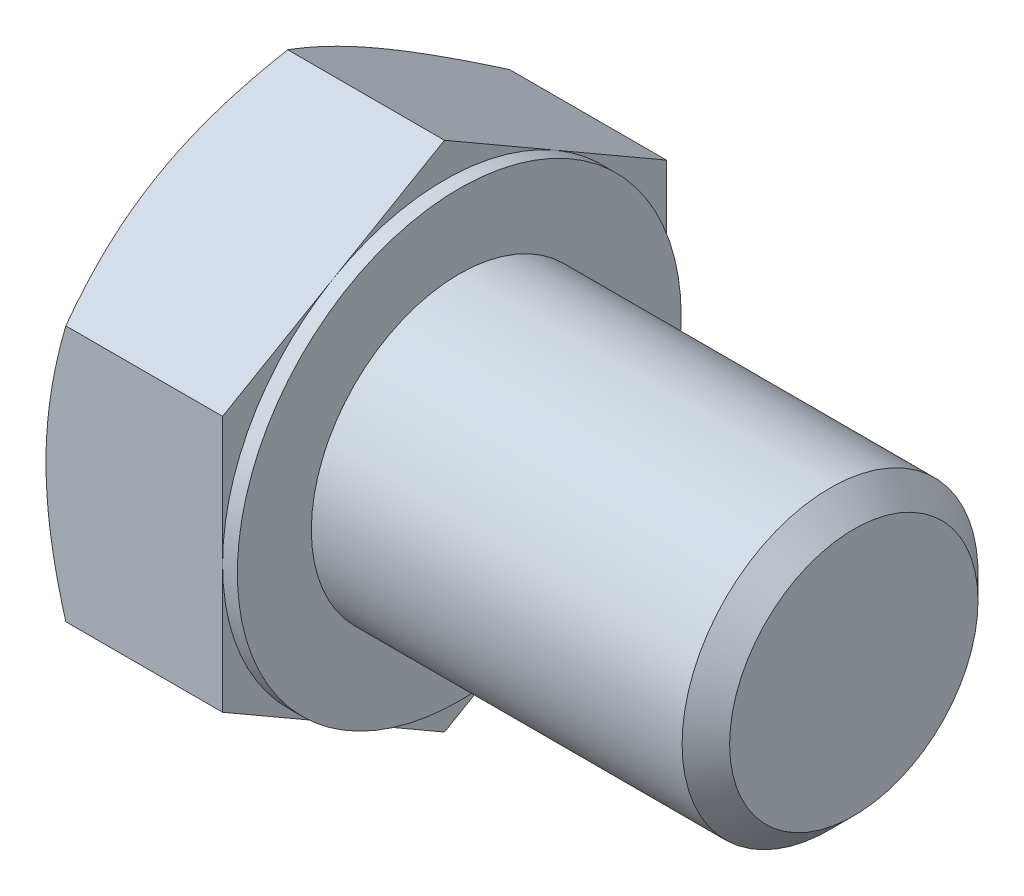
ISO-10303-21;
HEADER;
FILE_DESCRIPTION(('STEP AP214'),'2;1');
FILE_NAME('part.step','',(''),(''),'','','');
FILE_SCHEMA(('AUTOMOTIVE_DESIGN { 1 0 10303 214 1 1 1 1 }'));
ENDSEC;
DATA;
#1=APPLICATION_CONTEXT('core data for automotive mechanical design processes');
#2=APPLICATION_PROTOCOL_DEFINITION('international standard','automotive_design',2000,#1);
#3=PRODUCT_CONTEXT('',#1,'mechanical');
#4=PRODUCT('Part','Part','',(#3));
#5=PRODUCT_RELATED_PRODUCT_CATEGORY('part','',(#4));
#6=PRODUCT_DEFINITION_FORMATION('','',#4);
#7=PRODUCT_DEFINITION_CONTEXT('part definition',#1,'design');
#8=PRODUCT_DEFINITION('design','',#6,#7);
#9=PRODUCT_DEFINITION_SHAPE('','',#8);
#10=(LENGTH_UNIT() NAMED_UNIT(*) SI_UNIT(.MILLI.,.METRE.));
#11=(NAMED_UNIT(*) PLANE_ANGLE_UNIT() SI_UNIT($,.RADIAN.));
#12=(NAMED_UNIT(*) SI_UNIT($,.STERADIAN.) SOLID_ANGLE_UNIT());
#13=UNCERTAINTY_MEASURE_WITH_UNIT(LENGTH_MEASURE(1.E-05),#10,'distance_accuracy_value','');
#14=(GEOMETRIC_REPRESENTATION_CONTEXT(3) GLOBAL_UNCERTAINTY_ASSIGNED_CONTEXT((#13)) GLOBAL_UNIT_ASSIGNED_CONTEXT((#10,
#11,#12)) REPRESENTATION_CONTEXT('',''));
#15=CARTESIAN_POINT('',(0.,0.,0.));
#16=DIRECTION('',(0.,0.,1.));
#17=DIRECTION('',(1.,0.,0.));
#18=AXIS2_PLACEMENT_3D('',#15,#16,#17);
#19=CARTESIAN_POINT('',(7.76,5.19615242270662,-9.));
#20=DIRECTION('',(0.,-0.866025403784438,0.500000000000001));
#21=DIRECTION('',(0.,-0.500000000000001,-0.866025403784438));
#22=AXIS2_PLACEMENT_3D('',#19,#20,#21);
#23=PLANE('',#22);
#24=DIRECTION('',(0.,0.500000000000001,0.866025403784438));
#25=VECTOR('',#24,1.);
#26=CARTESIAN_POINT('',(7.16,5.19615242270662,-9.));
#27=LINE('',#26,#25);
#28=CARTESIAN_POINT('',(7.16,5.19615242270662,-9.));
#29=VERTEX_POINT('',#28);
#30=CARTESIAN_POINT('',(7.16,7.79422863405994,-4.50000000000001));
#31=VERTEX_POINT('',#30);
#32=EDGE_CURVE('E164',#29,#31,#27,.T.);
#33=ORIENTED_EDGE('',*,*,#32,.F.);
#34=DIRECTION('',(-1.,0.,0.));
#35=VECTOR('',#34,1.);
#36=CARTESIAN_POINT('',(7.76,5.19615242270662,-9.));
#37=LINE('',#36,#35);
#38=CARTESIAN_POINT('',(0.803847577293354,5.19615242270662,-9.));
#39=VERTEX_POINT('',#38);
#40=EDGE_CURVE('E297',#29,#39,#37,.T.);
#41=ORIENTED_EDGE('',*,*,#40,.T.);
#42=CARTESIAN_POINT('',(0.803914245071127,10.3924203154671,0.0002));
#43=CARTESIAN_POINT('',(0.737982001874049,10.2782163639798,-0.197607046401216));
#44=CARTESIAN_POINT('',(0.675041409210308,10.1635669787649,-0.396185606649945));
#45=CARTESIAN_POINT('',(0.555968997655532,9.93333715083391,-0.794955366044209));
#46=CARTESIAN_POINT('',(0.499840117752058,9.81775632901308,-0.99514722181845));
#47=CARTESIAN_POINT('',(0.395151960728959,9.58544915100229,-1.3975150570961));
#48=CARTESIAN_POINT('',(0.346610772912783,9.46872074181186,-1.59969459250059));
#49=CARTESIAN_POINT('',(0.258148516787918,9.23447001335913,-2.00542875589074));
#50=CARTESIAN_POINT('',(0.218225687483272,9.11694786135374,-2.20898309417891));
#51=CARTESIAN_POINT('',(0.148684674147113,8.88408932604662,-2.61230590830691));
#52=CARTESIAN_POINT('',(0.118837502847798,8.76877014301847,-2.812044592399));
#53=CARTESIAN_POINT('',(0.0687933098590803,8.53761579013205,-3.21241567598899));
#54=CARTESIAN_POINT('',(0.0485954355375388,8.42178066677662,-3.4130479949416));
#55=CARTESIAN_POINT('',(0.0183543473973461,8.18990950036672,-3.81466063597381));
#56=CARTESIAN_POINT('',(0.00829960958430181,8.07387383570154,-4.01564030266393));
#57=CARTESIAN_POINT('',(-0.00143766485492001,7.84169571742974,-4.41778459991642));
#58=CARTESIAN_POINT('',(-0.00112052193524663,7.72555326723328,-4.61894922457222));
#59=CARTESIAN_POINT('',(0.00916395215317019,7.50842142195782,-4.9950326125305));
#60=CARTESIAN_POINT('',(0.0178767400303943,7.40741671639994,-5.16997789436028));
#61=CARTESIAN_POINT('',(0.0429773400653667,7.20564389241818,-5.51945867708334));
#62=CARTESIAN_POINT('',(0.0593656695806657,7.10487579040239,-5.69399414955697));
#63=CARTESIAN_POINT('',(0.119656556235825,6.8029615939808,-6.2169248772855));
#64=CARTESIAN_POINT('',(0.174677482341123,6.60234990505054,-6.56439451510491));
#65=CARTESIAN_POINT('',(0.312230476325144,6.1989985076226,-7.263019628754));
#66=CARTESIAN_POINT('',(0.395345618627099,5.99631027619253,-7.61408594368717));
#67=CARTESIAN_POINT('',(0.583982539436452,5.59395639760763,-8.3109833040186));
#68=CARTESIAN_POINT('',(0.689460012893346,5.39428559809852,-8.65682327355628));
#69=CARTESIAN_POINT('',(0.80391424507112,5.19603695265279,-9.0002));
#70=B_SPLINE_CURVE_WITH_KNOTS('',3,(#42,#43,#44,#45,#46,#47,#48,#49,#50,#51,#52,#53,#54,#55,#56,
#57,#58,#59,#60,#61,#62,#63,#64,#65,#66,#67,#68,#69),.UNSPECIFIED.,.F.,.F.,(4,2,2,2,2,2,2,2,2,2,
2,2,2,4),(0.,0.713219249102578,1.42674513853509,2.14194697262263,2.8570025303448,
3.55449749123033,4.25193080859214,4.94857085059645,5.64518936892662,6.25162976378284,
6.8581110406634,8.07193747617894,9.31268391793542,10.5509947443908),.UNSPECIFIED.);
#71=CARTESIAN_POINT('',(0.,7.79422863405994,-4.50000000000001));
#72=VERTEX_POINT('',#71);
#73=EDGE_CURVE('E218',#72,#39,#70,.T.);
#74=ORIENTED_EDGE('',*,*,#73,.F.);
#75=CARTESIAN_POINT('',(0.803847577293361,10.3923048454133,0.));
#76=VERTEX_POINT('',#75);
#77=EDGE_CURVE('E55',#76,#72,#70,.T.);
#78=ORIENTED_EDGE('',*,*,#77,.F.);
#79=DIRECTION('',(-1.,0.,0.));
#80=VECTOR('',#79,1.);
#81=CARTESIAN_POINT('',(7.76,10.3923048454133,0.));
#82=LINE('',#81,#80);
#83=CARTESIAN_POINT('',(7.16,10.3923048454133,0.));
#84=VERTEX_POINT('',#83);
#85=EDGE_CURVE('E247',#84,#76,#82,.T.);
#86=ORIENTED_EDGE('',*,*,#85,.F.);
#87=EDGE_CURVE('E162',#31,#84,#27,.T.);
#88=ORIENTED_EDGE('',*,*,#87,.F.);
#89=EDGE_LOOP('',(#33,#41,#74,#78,#86,#88));
#90=FACE_BOUND('',#89,.T.);
#91=ADVANCED_FACE('F32',(#90),#23,.F.);
#92=CARTESIAN_POINT('',(7.76,10.3923048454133,0.));
#93=DIRECTION('',(0.,-0.866025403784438,-0.500000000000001));
#94=DIRECTION('',(0.,0.500000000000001,-0.866025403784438));
#95=AXIS2_PLACEMENT_3D('',#92,#93,#94);
#96=PLANE('',#95);
#97=DIRECTION('',(0.,-0.500000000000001,0.866025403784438));
#98=VECTOR('',#97,1.);
#99=CARTESIAN_POINT('',(7.16,10.3923048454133,0.));
#100=LINE('',#99,#98);
#101=CARTESIAN_POINT('',(7.16,7.79422863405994,4.50000000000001));
#102=VERTEX_POINT('',#101);
#103=EDGE_CURVE('E161',#84,#102,#100,.T.);
#104=ORIENTED_EDGE('',*,*,#103,.F.);
#105=ORIENTED_EDGE('',*,*,#85,.T.);
#106=CARTESIAN_POINT('',(0.803914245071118,5.19603695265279,9.0002));
#107=CARTESIAN_POINT('',(0.73798200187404,5.31024090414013,8.80239295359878));
#108=CARTESIAN_POINT('',(0.675041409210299,5.42489028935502,8.60381439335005));
#109=CARTESIAN_POINT('',(0.555968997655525,5.65512011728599,8.20504463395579));
#110=CARTESIAN_POINT('',(0.499840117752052,5.77070093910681,8.00485277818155));
#111=CARTESIAN_POINT('',(0.395151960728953,6.00300811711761,7.6024849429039));
#112=CARTESIAN_POINT('',(0.346610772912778,6.11973652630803,7.40030540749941));
#113=CARTESIAN_POINT('',(0.258148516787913,6.35398725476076,6.99457124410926));
#114=CARTESIAN_POINT('',(0.218225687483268,6.47150940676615,6.79101690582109));
#115=CARTESIAN_POINT('',(0.14868467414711,6.70436794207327,6.38769409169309));
#116=CARTESIAN_POINT('',(0.118837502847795,6.81968712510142,6.187955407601));
#117=CARTESIAN_POINT('',(0.068793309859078,7.05084147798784,5.78758432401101));
#118=CARTESIAN_POINT('',(0.0485954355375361,7.16667660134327,5.5869520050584));
#119=CARTESIAN_POINT('',(0.0183543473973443,7.39854776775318,5.18533936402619));
#120=CARTESIAN_POINT('',(0.00829960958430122,7.51458343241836,4.98435969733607));
#121=CARTESIAN_POINT('',(-0.00143766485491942,7.74676155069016,4.58221540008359));
#122=CARTESIAN_POINT('',(-0.0011205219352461,7.86290400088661,4.38105077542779));
#123=CARTESIAN_POINT('',(0.00916395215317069,8.08003584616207,4.00496738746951));
#124=CARTESIAN_POINT('',(0.0178767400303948,8.18104055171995,3.83002210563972));
#125=CARTESIAN_POINT('',(0.0429773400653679,8.38281337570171,3.48054132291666));
#126=CARTESIAN_POINT('',(0.0593656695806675,8.4835814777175,3.30600585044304));
#127=CARTESIAN_POINT('',(0.119656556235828,8.7854956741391,2.7830751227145));
#128=CARTESIAN_POINT('',(0.174677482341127,8.98610736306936,2.43560548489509));
#129=CARTESIAN_POINT('',(0.312230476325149,9.38945876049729,1.736980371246));
#130=CARTESIAN_POINT('',(0.395345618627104,9.59214699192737,1.38591405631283));
#131=CARTESIAN_POINT('',(0.583982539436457,9.99450087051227,0.689016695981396));
#132=CARTESIAN_POINT('',(0.689460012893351,10.1941716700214,0.343176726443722));
#133=CARTESIAN_POINT('',(0.803914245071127,10.3924203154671,-0.000200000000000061));
#134=B_SPLINE_CURVE_WITH_KNOTS('',3,(#106,#107,#108,#109,#110,#111,#112,#113,#114,#115,#116,
#117,#118,#119,#120,#121,#122,#123,#124,#125,#126,#127,#128,#129,#130,#131,#132,#133),
.UNSPECIFIED.,.F.,.F.,(4,2,2,2,2,2,2,2,2,2,2,2,2,4),(0.,0.713219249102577,1.42674513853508,
2.14194697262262,2.8570025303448,3.55449749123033,4.25193080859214,4.94857085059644,
5.64518936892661,6.25162976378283,6.85811104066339,8.07193747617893,9.31268391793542,
10.5509947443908),.UNSPECIFIED.);
#135=CARTESIAN_POINT('',(0.,7.79422863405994,4.50000000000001));
#136=VERTEX_POINT('',#135);
#137=EDGE_CURVE('E215',#136,#76,#134,.T.);
#138=ORIENTED_EDGE('',*,*,#137,.F.);
#139=CARTESIAN_POINT('',(0.803847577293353,5.19615242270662,9.));
#140=VERTEX_POINT('',#139);
#141=EDGE_CURVE('E228',#140,#136,#134,.T.);
#142=ORIENTED_EDGE('',*,*,#141,.F.);
#143=DIRECTION('',(-1.,0.,0.));
#144=VECTOR('',#143,1.);
#145=CARTESIAN_POINT('',(7.76,5.19615242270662,9.));
#146=LINE('',#145,#144);
#147=CARTESIAN_POINT('',(7.16,5.19615242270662,9.));
#148=VERTEX_POINT('',#147);
#149=EDGE_CURVE('E253',#148,#140,#146,.T.);
#150=ORIENTED_EDGE('',*,*,#149,.F.);
#151=EDGE_CURVE('E129',#102,#148,#100,.T.);
#152=ORIENTED_EDGE('',*,*,#151,.F.);
#153=EDGE_LOOP('',(#104,#105,#138,#142,#150,#152));
#154=FACE_BOUND('',#153,.T.);
#155=ADVANCED_FACE('F235',(#154),#96,.F.);
#156=CARTESIAN_POINT('',(7.76,5.19615242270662,9.));
#157=DIRECTION('',(0.,0.,-1.));
#158=DIRECTION('',(0.,1.,0.));
#159=AXIS2_PLACEMENT_3D('',#156,#157,#158);
#160=PLANE('',#159);
#161=DIRECTION('',(0.,-1.,0.));
#162=VECTOR('',#161,1.);
#163=CARTESIAN_POINT('',(7.16,5.19615242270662,9.));
#164=LINE('',#163,#162);
#165=CARTESIAN_POINT('',(7.16,0.,9.));
#166=VERTEX_POINT('',#165);
#167=EDGE_CURVE('E123',#148,#166,#164,.T.);
#168=ORIENTED_EDGE('',*,*,#167,.F.);
#169=ORIENTED_EDGE('',*,*,#149,.T.);
#170=CARTESIAN_POINT('',(4.50308345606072,-14.1853984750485,9.00000000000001));
#171=CARTESIAN_POINT('',(4.31054430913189,-13.790349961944,9.00000000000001));
#172=CARTESIAN_POINT('',(4.11978648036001,-13.3944187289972,9.00000000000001));
#173=CARTESIAN_POINT('',(3.74283091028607,-12.6003222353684,9.00000000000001));
#174=CARTESIAN_POINT('',(3.55663384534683,-12.2021566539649,9.));
#175=CARTESIAN_POINT('',(3.18890856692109,-11.4011784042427,9.));
#176=CARTESIAN_POINT('',(3.00740939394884,-10.998352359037,9.));
#177=CARTESIAN_POINT('',(2.65153988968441,-10.1895752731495,9.));
#178=CARTESIAN_POINT('',(2.47716923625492,-9.78362437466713,9.));
#179=CARTESIAN_POINT('',(2.13161245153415,-8.95398189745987,9.));
#180=CARTESIAN_POINT('',(1.9607400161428,-8.53015895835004,9.));
#181=CARTESIAN_POINT('',(1.63138410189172,-7.67764040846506,9.));
#182=CARTESIAN_POINT('',(1.47290198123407,-7.24894426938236,9.));
#183=CARTESIAN_POINT('',(1.17232155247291,-6.38672363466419,9.));
#184=CARTESIAN_POINT('',(1.03019194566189,-5.9532101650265,9.));
#185=CARTESIAN_POINT('',(0.766724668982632,-5.07998336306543,9.));
#186=CARTESIAN_POINT('',(0.645380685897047,-4.64027195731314,9.));
#187=CARTESIAN_POINT('',(0.429822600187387,-3.75682505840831,9.));
#188=CARTESIAN_POINT('',(0.335452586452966,-3.31312863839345,9.));
#189=CARTESIAN_POINT('',(0.218090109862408,-2.64336713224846,9.));
#190=CARTESIAN_POINT('',(0.182999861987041,-2.41939560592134,9.));
#191=CARTESIAN_POINT('',(0.121565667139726,-1.97026354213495,9.));
#192=CARTESIAN_POINT('',(0.09522086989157,-1.74510312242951,9.));
#193=CARTESIAN_POINT('',(0.0521451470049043,-1.29693480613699,9.));
#194=CARTESIAN_POINT('',(0.0352889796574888,-1.0739389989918,9.));
#195=CARTESIAN_POINT('',(0.0110310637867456,-0.627433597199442,9.));
#196=CARTESIAN_POINT('',(0.00362915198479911,-0.403924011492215,9.));
#197=CARTESIAN_POINT('',(-0.00154262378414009,0.0432079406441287,9.));
#198=CARTESIAN_POINT('',(0.000687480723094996,0.266830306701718,9.));
#199=CARTESIAN_POINT('',(0.0147226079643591,0.713776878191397,9.));
#200=CARTESIAN_POINT('',(0.0265280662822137,0.937101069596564,9.));
#201=CARTESIAN_POINT('',(0.0656502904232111,1.46707212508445,9.));
#202=CARTESIAN_POINT('',(0.0971347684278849,1.7734184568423,9.));
#203=CARTESIAN_POINT('',(0.176454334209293,2.38397028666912,9.));
#204=CARTESIAN_POINT('',(0.224291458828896,2.68817551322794,9.));
#205=CARTESIAN_POINT('',(0.389806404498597,3.59715813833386,9.));
#206=CARTESIAN_POINT('',(0.529461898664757,4.1979941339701,9.));
#207=CARTESIAN_POINT('',(0.773331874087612,5.0967070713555,9.));
#208=CARTESIAN_POINT('',(0.861532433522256,5.39919911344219,9.));
#209=CARTESIAN_POINT('',(1.0475209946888,6.00125026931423,9.));
#210=CARTESIAN_POINT('',(1.14530906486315,6.30080936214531,9.));
#211=CARTESIAN_POINT('',(1.34886866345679,6.89708059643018,9.));
#212=CARTESIAN_POINT('',(1.45463788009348,7.19379353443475,9.));
#213=CARTESIAN_POINT('',(1.67287302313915,7.78473288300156,9.));
#214=CARTESIAN_POINT('',(1.78533883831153,8.07895933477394,9.));
#215=CARTESIAN_POINT('',(2.07523735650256,8.81619445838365,9.));
#216=CARTESIAN_POINT('',(2.25629467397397,9.25777585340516,9.));
#217=CARTESIAN_POINT('',(2.62827522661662,10.136777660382,9.));
#218=CARTESIAN_POINT('',(2.81919929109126,10.574197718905,9.));
#219=CARTESIAN_POINT('',(3.20877963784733,11.445728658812,9.));
#220=CARTESIAN_POINT('',(3.40743823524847,11.8798385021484,9.));
#221=CARTESIAN_POINT('',(3.81079737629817,12.745217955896,9.));
#222=CARTESIAN_POINT('',(4.01549773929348,13.176487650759,8.99999999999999));
#223=CARTESIAN_POINT('',(4.43000777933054,14.0372827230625,8.99999999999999));
#224=CARTESIAN_POINT('',(4.63982402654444,14.4668049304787,8.99999999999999));
#225=CARTESIAN_POINT('',(5.06336871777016,15.3239162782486,8.99999999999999));
#226=CARTESIAN_POINT('',(5.27709718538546,15.7515054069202,8.99999999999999));
#227=CARTESIAN_POINT('',(5.70771290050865,16.6049951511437,8.99999999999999));
#228=CARTESIAN_POINT('',(5.9245995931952,17.0308960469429,8.99999999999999));
#229=CARTESIAN_POINT('',(6.36101693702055,17.8813418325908,8.99999999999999));
#230=CARTESIAN_POINT('',(6.58054759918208,18.3058867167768,8.99999999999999));
#231=CARTESIAN_POINT('',(7.20096689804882,19.4981240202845,8.99999999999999));
#232=CARTESIAN_POINT('',(7.60436223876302,20.2645118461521,8.99999999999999));
#233=CARTESIAN_POINT('',(8.41646748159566,21.794506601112,8.99999999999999));
#234=CARTESIAN_POINT('',(8.82517763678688,22.558113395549,8.99999999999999));
#235=CARTESIAN_POINT('',(9.64538992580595,24.0808854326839,8.99999999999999));
#236=CARTESIAN_POINT('',(10.0568800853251,24.8400571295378,8.99999999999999));
#237=CARTESIAN_POINT('',(10.6764233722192,25.977523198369,8.99999999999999));
#238=CARTESIAN_POINT('',(10.883315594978,26.3564507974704,8.99999999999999));
#239=CARTESIAN_POINT('',(11.2977907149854,27.113927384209,8.99999999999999));
#240=CARTESIAN_POINT('',(11.505373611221,27.4924763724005,8.99999999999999));
#241=CARTESIAN_POINT('',(11.713260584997,27.8708583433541,8.99999999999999));
#242=B_SPLINE_CURVE_WITH_KNOTS('',3,(#170,#171,#172,#173,#174,#175,#176,#177,#178,#179,#180,
#181,#182,#183,#184,#185,#186,#187,#188,#189,#190,#191,#192,#193,#194,#195,#196,#197,#198,#199,
#200,#201,#202,#203,#204,#205,#206,#207,#208,#209,#210,#211,#212,#213,#214,#215,#216,#217,#218,
#219,#220,#221,#222,#223,#224,#225,#226,#227,#228,#229,#230,#231,#232,#233,#234,#235,#236,#237,
#238,#239,#240,#241),.UNSPECIFIED.,.F.,.F.,(4,2,2,2,2,2,2,2,2,2,2,2,2,2,2,2,2,2,2,2,2,2,2,2,2,2,
2,2,2,2,2,2,2,2,2,4),(0.,1.3184276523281,2.63704965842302,3.96247407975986,5.2878385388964,
6.65860359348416,8.02951869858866,9.39776461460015,10.7655942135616,12.1253499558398,
12.8053173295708,13.4852185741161,14.1559216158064,14.8266130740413,15.497302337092,
16.1680221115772,17.0913849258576,18.0148627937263,19.8627426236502,20.8079230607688,
21.7531102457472,22.6980246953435,23.6429234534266,25.0745302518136,26.506257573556,
27.9384167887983,29.3705332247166,30.804597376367,32.2386701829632,33.6724940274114,
35.1063238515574,37.7045032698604,40.3028068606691,42.8933552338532,44.1885437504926,
45.4837303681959),.UNSPECIFIED.);
#243=CARTESIAN_POINT('',(0.,0.,9.));
#244=VERTEX_POINT('',#243);
#245=EDGE_CURVE('E229',#244,#140,#242,.T.);
#246=ORIENTED_EDGE('',*,*,#245,.F.);
#247=CARTESIAN_POINT('',(0.80384757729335,-5.19615242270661,9.));
#248=VERTEX_POINT('',#247);
#249=EDGE_CURVE('E306',#248,#244,#242,.T.);
#250=ORIENTED_EDGE('',*,*,#249,.F.);
#251=DIRECTION('',(-1.,0.,0.));
#252=VECTOR('',#251,1.);
#253=CARTESIAN_POINT('',(7.76,-5.19615242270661,9.));
#254=LINE('',#253,#252);
#255=CARTESIAN_POINT('',(7.16,-5.19615242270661,9.));
#256=VERTEX_POINT('',#255);
#257=EDGE_CURVE('E155',#256,#248,#254,.T.);
#258=ORIENTED_EDGE('',*,*,#257,.F.);
#259=EDGE_CURVE('E133',#166,#256,#164,.T.);
#260=ORIENTED_EDGE('',*,*,#259,.F.);
#261=EDGE_LOOP('',(#168,#169,#246,#250,#258,#260));
#262=FACE_BOUND('',#261,.T.);
#263=ADVANCED_FACE('F153',(#262),#160,.F.);
#264=CARTESIAN_POINT('',(7.76,-10.3923048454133,0.));
#265=DIRECTION('',(0.,0.866025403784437,-0.500000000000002));
#266=DIRECTION('',(0.,0.500000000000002,0.866025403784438));
#267=AXIS2_PLACEMENT_3D('',#264,#265,#266);
#268=PLANE('',#267);
#269=DIRECTION('',(0.,-0.500000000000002,-0.866025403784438));
#270=VECTOR('',#269,1.);
#271=CARTESIAN_POINT('',(7.16,-10.3923048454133,0.));
#272=LINE('',#271,#270);
#273=CARTESIAN_POINT('',(7.16,-7.79422863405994,4.50000000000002));
#274=VERTEX_POINT('',#273);
#275=EDGE_CURVE('E140',#256,#274,#272,.T.);
#276=ORIENTED_EDGE('',*,*,#275,.F.);
#277=ORIENTED_EDGE('',*,*,#257,.T.);
#278=CARTESIAN_POINT('',(0.803914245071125,-10.3924203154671,-0.000200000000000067));
#279=CARTESIAN_POINT('',(0.737982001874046,-10.2782163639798,0.197607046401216));
#280=CARTESIAN_POINT('',(0.675041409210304,-10.1635669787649,0.396185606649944));
#281=CARTESIAN_POINT('',(0.55596899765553,-9.93333715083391,0.794955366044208));
#282=CARTESIAN_POINT('',(0.499840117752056,-9.81775632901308,0.995147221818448));
#283=CARTESIAN_POINT('',(0.395151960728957,-9.58544915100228,1.39751505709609));
#284=CARTESIAN_POINT('',(0.34661077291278,-9.46872074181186,1.59969459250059));
#285=CARTESIAN_POINT('',(0.258148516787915,-9.23447001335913,2.00542875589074));
#286=CARTESIAN_POINT('',(0.218225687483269,-9.11694786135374,2.20898309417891));
#287=CARTESIAN_POINT('',(0.14868467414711,-8.88408932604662,2.61230590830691));
#288=CARTESIAN_POINT('',(0.118837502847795,-8.76877014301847,2.812044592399));
#289=CARTESIAN_POINT('',(0.0687933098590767,-8.53761579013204,3.21241567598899));
#290=CARTESIAN_POINT('',(0.0485954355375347,-8.42178066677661,3.4130479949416));
#291=CARTESIAN_POINT('',(0.0183543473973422,-8.18990950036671,3.81466063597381));
#292=CARTESIAN_POINT('',(0.0082996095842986,-8.07387383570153,4.01564030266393));
#293=CARTESIAN_POINT('',(-0.00143766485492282,-7.84169571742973,4.41778459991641));
#294=CARTESIAN_POINT('',(-0.00112052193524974,-7.72555326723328,4.61894922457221));
#295=CARTESIAN_POINT('',(0.00916395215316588,-7.50842142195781,4.99503261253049));
#296=CARTESIAN_POINT('',(0.0178767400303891,-7.40741671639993,5.16997789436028));
#297=CARTESIAN_POINT('',(0.0429773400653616,-7.20564389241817,5.51945867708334));
#298=CARTESIAN_POINT('',(0.0593656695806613,-7.10487579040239,5.69399414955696));
#299=CARTESIAN_POINT('',(0.119656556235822,-6.80296159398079,6.2169248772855));
#300=CARTESIAN_POINT('',(0.174677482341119,-6.60234990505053,6.56439451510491));
#301=CARTESIAN_POINT('',(0.312230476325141,-6.19899850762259,7.263019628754));
#302=CARTESIAN_POINT('',(0.395345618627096,-5.99631027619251,7.61408594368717));
#303=CARTESIAN_POINT('',(0.583982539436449,-5.59395639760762,8.31098330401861));
#304=CARTESIAN_POINT('',(0.689460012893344,-5.39428559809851,8.65682327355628));
#305=CARTESIAN_POINT('',(0.803914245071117,-5.19603695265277,9.0002));
#306=B_SPLINE_CURVE_WITH_KNOTS('',3,(#278,#279,#280,#281,#282,#283,#284,#285,#286,#287,#288,
#289,#290,#291,#292,#293,#294,#295,#296,#297,#298,#299,#300,#301,#302,#303,#304,#305),
.UNSPECIFIED.,.F.,.F.,(4,2,2,2,2,2,2,2,2,2,2,2,2,4),(0.,0.713219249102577,1.42674513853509,
2.14194697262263,2.8570025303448,3.55449749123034,4.25193080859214,4.94857085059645,
5.64518936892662,6.25162976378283,6.8581110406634,8.07193747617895,9.31268391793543,
10.5509947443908),.UNSPECIFIED.);
#307=CARTESIAN_POINT('',(0.,-7.79422863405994,4.50000000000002));
#308=VERTEX_POINT('',#307);
#309=EDGE_CURVE('E217',#308,#248,#306,.T.);
#310=ORIENTED_EDGE('',*,*,#309,.F.);
#311=CARTESIAN_POINT('',(0.803847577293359,-10.3923048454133,0.));
#312=VERTEX_POINT('',#311);
#313=EDGE_CURVE('E209',#312,#308,#306,.T.);
#314=ORIENTED_EDGE('',*,*,#313,.F.);
#315=DIRECTION('',(-1.,0.,0.));
#316=VECTOR('',#315,1.);
#317=CARTESIAN_POINT('',(7.76,-10.3923048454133,0.));
#318=LINE('',#317,#316);
#319=CARTESIAN_POINT('',(7.16,-10.3923048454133,0.));
#320=VERTEX_POINT('',#319);
#321=EDGE_CURVE('E291',#320,#312,#318,.T.);
#322=ORIENTED_EDGE('',*,*,#321,.F.);
#323=EDGE_CURVE('E156',#274,#320,#272,.T.);
#324=ORIENTED_EDGE('',*,*,#323,.F.);
#325=EDGE_LOOP('',(#276,#277,#310,#314,#322,#324));
#326=FACE_BOUND('',#325,.T.);
#327=ADVANCED_FACE('F201',(#326),#268,.F.);
#328=CARTESIAN_POINT('',(7.76,-5.19615242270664,-9.00000000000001));
#329=DIRECTION('',(0.,0.866025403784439,0.499999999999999));
#330=DIRECTION('',(0.,-0.5,0.866025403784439));
#331=AXIS2_PLACEMENT_3D('',#328,#329,#330);
#332=PLANE('',#331);
#333=DIRECTION('',(0.,0.5,-0.866025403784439));
#334=VECTOR('',#333,1.);
#335=CARTESIAN_POINT('',(7.16,-5.19615242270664,-9.00000000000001));
#336=LINE('',#335,#334);
#337=CARTESIAN_POINT('',(7.16,-7.79422863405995,-4.5));
#338=VERTEX_POINT('',#337);
#339=EDGE_CURVE('E510',#320,#338,#336,.T.);
#340=ORIENTED_EDGE('',*,*,#339,.F.);
#341=ORIENTED_EDGE('',*,*,#321,.T.);
#342=CARTESIAN_POINT('',(0.803914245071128,-5.1960369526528,-9.0002));
#343=CARTESIAN_POINT('',(0.73798200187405,-5.31024090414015,-8.80239295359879));
#344=CARTESIAN_POINT('',(0.675041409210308,-5.42489028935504,-8.60381439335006));
#345=CARTESIAN_POINT('',(0.555968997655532,-5.655120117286,-8.2050446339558));
#346=CARTESIAN_POINT('',(0.499840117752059,-5.77070093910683,-8.00485277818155));
#347=CARTESIAN_POINT('',(0.39515196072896,-6.00300811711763,-7.60248494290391));
#348=CARTESIAN_POINT('',(0.346610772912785,-6.11973652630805,-7.40030540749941));
#349=CARTESIAN_POINT('',(0.25814851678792,-6.35398725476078,-6.99457124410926));
#350=CARTESIAN_POINT('',(0.218225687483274,-6.47150940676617,-6.79101690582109));
#351=CARTESIAN_POINT('',(0.148684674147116,-6.70436794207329,-6.38769409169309));
#352=CARTESIAN_POINT('',(0.118837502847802,-6.81968712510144,-6.187955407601));
#353=CARTESIAN_POINT('',(0.0687933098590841,-7.05084147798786,-5.78758432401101));
#354=CARTESIAN_POINT('',(0.048595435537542,-7.16667660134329,-5.5869520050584));
#355=CARTESIAN_POINT('',(0.0183543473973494,-7.39854776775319,-5.18533936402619));
#356=CARTESIAN_POINT('',(0.00829960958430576,-7.51458343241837,-4.98435969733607));
#357=CARTESIAN_POINT('',(-0.00143766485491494,-7.74676155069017,-4.58221540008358));
#358=CARTESIAN_POINT('',(-0.0011205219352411,-7.86290400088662,-4.38105077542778));
#359=CARTESIAN_POINT('',(0.00916395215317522,-8.08003584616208,-4.0049673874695));
#360=CARTESIAN_POINT('',(0.0178767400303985,-8.18104055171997,-3.83002210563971));
#361=CARTESIAN_POINT('',(0.0429773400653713,-8.38281337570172,-3.48054132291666));
#362=CARTESIAN_POINT('',(0.0593656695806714,-8.48358147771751,-3.30600585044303));
#363=CARTESIAN_POINT('',(0.119656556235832,-8.7854956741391,-2.7830751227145));
#364=CARTESIAN_POINT('',(0.17467748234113,-8.98610736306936,-2.43560548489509));
#365=CARTESIAN_POINT('',(0.31223047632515,-9.38945876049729,-1.736980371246));
#366=CARTESIAN_POINT('',(0.395345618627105,-9.59214699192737,-1.38591405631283));
#367=CARTESIAN_POINT('',(0.583982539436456,-9.99450087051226,-0.689016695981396));
#368=CARTESIAN_POINT('',(0.689460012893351,-10.1941716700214,-0.343176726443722));
#369=CARTESIAN_POINT('',(0.803914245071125,-10.3924203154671,0.000200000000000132));
#370=B_SPLINE_CURVE_WITH_KNOTS('',3,(#342,#343,#344,#345,#346,#347,#348,#349,#350,#351,#352,
#353,#354,#355,#356,#357,#358,#359,#360,#361,#362,#363,#364,#365,#366,#367,#368,#369),
.UNSPECIFIED.,.F.,.F.,(4,2,2,2,2,2,2,2,2,2,2,2,2,4),(0.,0.713219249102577,1.42674513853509,
2.14194697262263,2.8570025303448,3.55449749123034,4.25193080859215,4.94857085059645,
5.64518936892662,6.25162976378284,6.8581110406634,8.07193747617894,9.31268391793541,
10.5509947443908),.UNSPECIFIED.);
#371=CARTESIAN_POINT('',(0.,-7.79422863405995,-4.5));
#372=VERTEX_POINT('',#371);
#373=EDGE_CURVE('E216',#372,#312,#370,.T.);
#374=ORIENTED_EDGE('',*,*,#373,.F.);
#375=CARTESIAN_POINT('',(0.803847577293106,-5.19615242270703,-9.00000000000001));
#376=VERTEX_POINT('',#375);
#377=EDGE_CURVE('E178',#376,#372,#370,.T.);
#378=ORIENTED_EDGE('',*,*,#377,.F.);
#379=DIRECTION('',(-1.,0.,0.));
#380=VECTOR('',#379,1.);
#381=CARTESIAN_POINT('',(7.76,-5.19615242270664,-9.00000000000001));
#382=LINE('',#381,#380);
#383=CARTESIAN_POINT('',(7.16,-5.19615242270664,-9.00000000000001));
#384=VERTEX_POINT('',#383);
#385=EDGE_CURVE('E298',#384,#376,#382,.T.);
#386=ORIENTED_EDGE('',*,*,#385,.F.);
#387=EDGE_CURVE('E151',#338,#384,#336,.T.);
#388=ORIENTED_EDGE('',*,*,#387,.F.);
#389=EDGE_LOOP('',(#340,#341,#374,#378,#386,#388));
#390=FACE_BOUND('',#389,.T.);
#391=ADVANCED_FACE('F194',(#390),#332,.F.);
#392=CARTESIAN_POINT('',(7.76,5.19615242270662,-9.));
#393=DIRECTION('',(0.,0.,1.));
#394=DIRECTION('',(0.,-1.,0.));
#395=AXIS2_PLACEMENT_3D('',#392,#393,#394);
#396=PLANE('',#395);
#397=DIRECTION('',(0.,1.,0.));
#398=VECTOR('',#397,1.);
#399=CARTESIAN_POINT('',(7.16,5.19615242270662,-9.));
#400=LINE('',#399,#398);
#401=CARTESIAN_POINT('',(7.16,0.,-9.));
#402=VERTEX_POINT('',#401);
#403=EDGE_CURVE('E11',#384,#402,#400,.T.);
#404=ORIENTED_EDGE('',*,*,#403,.F.);
#405=ORIENTED_EDGE('',*,*,#385,.T.);
#406=CARTESIAN_POINT('',(4.50308345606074,-14.1853984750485,-9.00000000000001));
#407=CARTESIAN_POINT('',(4.31054430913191,-13.7903499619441,-9.00000000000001));
#408=CARTESIAN_POINT('',(4.11978648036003,-13.3944187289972,-9.00000000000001));
#409=CARTESIAN_POINT('',(3.74283091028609,-12.6003222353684,-9.00000000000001));
#410=CARTESIAN_POINT('',(3.55663384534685,-12.2021566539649,-9.00000000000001));
#411=CARTESIAN_POINT('',(3.18890856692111,-11.4011784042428,-9.00000000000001));
#412=CARTESIAN_POINT('',(3.00740939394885,-10.998352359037,-9.00000000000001));
#413=CARTESIAN_POINT('',(2.65153988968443,-10.1895752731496,-9.00000000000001));
#414=CARTESIAN_POINT('',(2.47716923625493,-9.78362437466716,-9.00000000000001));
#415=CARTESIAN_POINT('',(2.13161245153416,-8.9539818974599,-9.00000000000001));
#416=CARTESIAN_POINT('',(1.96074001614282,-8.53015895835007,-9.00000000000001));
#417=CARTESIAN_POINT('',(1.63138410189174,-7.67764040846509,-9.00000000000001));
#418=CARTESIAN_POINT('',(1.47290198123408,-7.2489442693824,-9.00000000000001));
#419=CARTESIAN_POINT('',(1.17232155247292,-6.38672363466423,-9.00000000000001));
#420=CARTESIAN_POINT('',(1.0301919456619,-5.95321016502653,-9.00000000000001));
#421=CARTESIAN_POINT('',(0.766724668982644,-5.07998336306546,-9.00000000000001));
#422=CARTESIAN_POINT('',(0.645380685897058,-4.64027195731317,-9.00000000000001));
#423=CARTESIAN_POINT('',(0.429822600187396,-3.75682505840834,-9.00000000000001));
#424=CARTESIAN_POINT('',(0.335452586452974,-3.31312863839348,-9.00000000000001));
#425=CARTESIAN_POINT('',(0.218090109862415,-2.64336713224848,-9.00000000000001));
#426=CARTESIAN_POINT('',(0.182999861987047,-2.41939560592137,-9.));
#427=CARTESIAN_POINT('',(0.121565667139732,-1.97026354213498,-9.));
#428=CARTESIAN_POINT('',(0.0952208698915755,-1.74510312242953,-9.));
#429=CARTESIAN_POINT('',(0.0521451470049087,-1.29693480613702,-9.));
#430=CARTESIAN_POINT('',(0.0352889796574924,-1.07393899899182,-9.));
#431=CARTESIAN_POINT('',(0.0110310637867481,-0.627433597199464,-9.));
#432=CARTESIAN_POINT('',(0.00362915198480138,-0.403924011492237,-9.));
#433=CARTESIAN_POINT('',(-0.00154262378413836,0.043207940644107,-9.));
#434=CARTESIAN_POINT('',(0.000687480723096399,0.266830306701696,-9.));
#435=CARTESIAN_POINT('',(0.0147226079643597,0.713776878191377,-9.));
#436=CARTESIAN_POINT('',(0.0265280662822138,0.937101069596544,-9.));
#437=CARTESIAN_POINT('',(0.0656502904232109,1.46707212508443,-9.));
#438=CARTESIAN_POINT('',(0.0971347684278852,1.77341845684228,-9.));
#439=CARTESIAN_POINT('',(0.176454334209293,2.3839702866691,-9.));
#440=CARTESIAN_POINT('',(0.224291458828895,2.68817551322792,-9.));
#441=CARTESIAN_POINT('',(0.389806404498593,3.59715813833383,-9.));
#442=CARTESIAN_POINT('',(0.529461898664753,4.19799413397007,-9.));
#443=CARTESIAN_POINT('',(0.773331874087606,5.09670707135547,-9.));
#444=CARTESIAN_POINT('',(0.86153243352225,5.39919911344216,-9.));
#445=CARTESIAN_POINT('',(1.04752099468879,6.0012502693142,-9.));
#446=CARTESIAN_POINT('',(1.14530906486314,6.30080936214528,-9.));
#447=CARTESIAN_POINT('',(1.34886866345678,6.89708059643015,-9.));
#448=CARTESIAN_POINT('',(1.45463788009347,7.19379353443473,-9.));
#449=CARTESIAN_POINT('',(1.67287302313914,7.78473288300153,-9.));
#450=CARTESIAN_POINT('',(1.78533883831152,8.07895933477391,-9.));
#451=CARTESIAN_POINT('',(2.07523735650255,8.81619445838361,-9.));
#452=CARTESIAN_POINT('',(2.25629467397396,9.25777585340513,-9.));
#453=CARTESIAN_POINT('',(2.62827522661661,10.136777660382,-9.));
#454=CARTESIAN_POINT('',(2.81919929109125,10.5741977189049,-9.));
#455=CARTESIAN_POINT('',(3.20877963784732,11.445728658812,-9.));
#456=CARTESIAN_POINT('',(3.40743823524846,11.8798385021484,-9.));
#457=CARTESIAN_POINT('',(3.81079737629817,12.745217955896,-9.));
#458=CARTESIAN_POINT('',(4.01549773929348,13.176487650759,-9.));
#459=CARTESIAN_POINT('',(4.43000777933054,14.0372827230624,-9.));
#460=CARTESIAN_POINT('',(4.63982402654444,14.4668049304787,-9.));
#461=CARTESIAN_POINT('',(5.06336871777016,15.3239162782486,-9.));
#462=CARTESIAN_POINT('',(5.27709718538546,15.7515054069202,-9.));
#463=CARTESIAN_POINT('',(5.70771290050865,16.6049951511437,-9.));
#464=CARTESIAN_POINT('',(5.9245995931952,17.0308960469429,-9.));
#465=CARTESIAN_POINT('',(6.36101693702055,17.8813418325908,-9.));
#466=CARTESIAN_POINT('',(6.58054759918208,18.3058867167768,-9.));
#467=CARTESIAN_POINT('',(7.20096689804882,19.4981240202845,-8.99999999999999));
#468=CARTESIAN_POINT('',(7.60436223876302,20.2645118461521,-9.));
#469=CARTESIAN_POINT('',(8.41646748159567,21.794506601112,-9.));
#470=CARTESIAN_POINT('',(8.82517763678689,22.558113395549,-9.));
#471=CARTESIAN_POINT('',(9.64538992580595,24.0808854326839,-9.));
#472=CARTESIAN_POINT('',(10.0568800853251,24.8400571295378,-8.99999999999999));
#473=CARTESIAN_POINT('',(10.6764233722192,25.977523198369,-8.99999999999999));
#474=CARTESIAN_POINT('',(10.883315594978,26.3564507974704,-8.99999999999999));
#475=CARTESIAN_POINT('',(11.2977907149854,27.113927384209,-8.99999999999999));
#476=CARTESIAN_POINT('',(11.505373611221,27.4924763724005,-8.99999999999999));
#477=CARTESIAN_POINT('',(11.713260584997,27.8708583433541,-8.99999999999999));
#478=B_SPLINE_CURVE_WITH_KNOTS('',3,(#406,#407,#408,#409,#410,#411,#412,#413,#414,#415,#416,
#417,#418,#419,#420,#421,#422,#423,#424,#425,#426,#427,#428,#429,#430,#431,#432,#433,#434,#435,
#436,#437,#438,#439,#440,#441,#442,#443,#444,#445,#446,#447,#448,#449,#450,#451,#452,#453,#454,
#455,#456,#457,#458,#459,#460,#461,#462,#463,#464,#465,#466,#467,#468,#469,#470,#471,#472,#473,
#474,#475,#476,#477),.UNSPECIFIED.,.F.,.F.,(4,2,2,2,2,2,2,2,2,2,2,2,2,2,2,2,2,2,2,2,2,2,2,2,2,2,
2,2,2,2,2,2,2,2,2,4),(0.,1.3184276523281,2.63704965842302,3.96247407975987,5.28783853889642,
6.65860359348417,8.02951869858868,9.39776461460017,10.7655942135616,12.1253499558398,
12.8053173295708,13.4852185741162,14.1559216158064,14.8266130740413,15.497302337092,
16.1680221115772,17.0913849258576,18.0148627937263,19.8627426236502,20.8079230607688,
21.7531102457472,22.6980246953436,23.6429234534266,25.0745302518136,26.506257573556,
27.9384167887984,29.3705332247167,30.804597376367,32.2386701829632,33.6724940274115,
35.1063238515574,37.7045032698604,40.3028068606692,42.8933552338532,44.1885437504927,
45.4837303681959),.UNSPECIFIED.);
#479=CARTESIAN_POINT('',(0.,0.,-9.));
#480=VERTEX_POINT('',#479);
#481=EDGE_CURVE('E168',#480,#376,#478,.F.);
#482=ORIENTED_EDGE('',*,*,#481,.F.);
#483=EDGE_CURVE('E177',#39,#480,#478,.F.);
#484=ORIENTED_EDGE('',*,*,#483,.F.);
#485=ORIENTED_EDGE('',*,*,#40,.F.);
#486=EDGE_CURVE('E36',#402,#29,#400,.T.);
#487=ORIENTED_EDGE('',*,*,#486,.F.);
#488=EDGE_LOOP('',(#404,#405,#482,#484,#485,#487));
#489=FACE_BOUND('',#488,.T.);
#490=ADVANCED_FACE('F189',(#489),#396,.F.);
#491=CARTESIAN_POINT('',(0.,0.,0.));
#492=DIRECTION('',(1.,0.,0.));
#493=DIRECTION('',(0.,0.,-1.));
#494=AXIS2_PLACEMENT_3D('',#491,#492,#493);
#495=CONICAL_SURFACE('',#494,9.,1.0471975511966);
#496=ORIENTED_EDGE('',*,*,#377,.T.);
#497=CARTESIAN_POINT('',(0.,0.,0.));
#498=DIRECTION('',(1.,0.,0.));
#499=DIRECTION('',(0.,0.,-1.));
#500=AXIS2_PLACEMENT_3D('',#497,#498,#499);
#501=CIRCLE('',#500,9.);
#502=EDGE_CURVE('E252',#372,#480,#501,.T.);
#503=ORIENTED_EDGE('',*,*,#502,.T.);
#504=ORIENTED_EDGE('',*,*,#481,.T.);
#505=EDGE_LOOP('',(#496,#503,#504));
#506=FACE_BOUND('',#505,.T.);
#507=ADVANCED_FACE('F193',(#506),#495,.T.);
#508=ORIENTED_EDGE('',*,*,#313,.T.);
#509=EDGE_CURVE('E256',#308,#372,#501,.T.);
#510=ORIENTED_EDGE('',*,*,#509,.T.);
#511=ORIENTED_EDGE('',*,*,#373,.T.);
#512=EDGE_LOOP('',(#508,#510,#511));
#513=FACE_BOUND('',#512,.T.);
#514=ADVANCED_FACE('F279',(#513),#495,.T.);
#515=ORIENTED_EDGE('',*,*,#249,.T.);
#516=EDGE_CURVE('E270',#244,#308,#501,.T.);
#517=ORIENTED_EDGE('',*,*,#516,.T.);
#518=ORIENTED_EDGE('',*,*,#309,.T.);
#519=EDGE_LOOP('',(#515,#517,#518));
#520=FACE_BOUND('',#519,.T.);
#521=ADVANCED_FACE('F185',(#520),#495,.T.);
#522=ORIENTED_EDGE('',*,*,#245,.T.);
#523=ORIENTED_EDGE('',*,*,#141,.T.);
#524=CARTESIAN_POINT('',(0.,0.,0.));
#525=DIRECTION('',(-1.,0.,0.));
#526=DIRECTION('',(0.,0.,1.));
#527=AXIS2_PLACEMENT_3D('',#524,#525,#526);
#528=CIRCLE('',#527,9.);
#529=EDGE_CURVE('E165',#244,#136,#528,.T.);
#530=ORIENTED_EDGE('',*,*,#529,.F.);
#531=EDGE_LOOP('',(#522,#523,#530));
#532=FACE_BOUND('',#531,.T.);
#533=ADVANCED_FACE('F316',(#532),#495,.T.);
#534=ORIENTED_EDGE('',*,*,#137,.T.);
#535=ORIENTED_EDGE('',*,*,#77,.T.);
#536=EDGE_CURVE('E265',#72,#136,#501,.T.);
#537=ORIENTED_EDGE('',*,*,#536,.T.);
#538=EDGE_LOOP('',(#534,#535,#537));
#539=FACE_BOUND('',#538,.T.);
#540=ADVANCED_FACE('F317',(#539),#495,.T.);
#541=ORIENTED_EDGE('',*,*,#73,.T.);
#542=ORIENTED_EDGE('',*,*,#483,.T.);
#543=EDGE_CURVE('E258',#480,#72,#501,.T.);
#544=ORIENTED_EDGE('',*,*,#543,.T.);
#545=EDGE_LOOP('',(#541,#542,#544));
#546=FACE_BOUND('',#545,.T.);
#547=ADVANCED_FACE('F293',(#546),#495,.T.);
#548=CARTESIAN_POINT('',(0.97,0.192376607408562,0.0332122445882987));
#549=DIRECTION('',(-1.,0.,0.));
#550=DIRECTION('',(0.,0.,1.));
#551=AXIS2_PLACEMENT_3D('',#548,#549,#550);
#552=PLANE('',#551);
#553=CARTESIAN_POINT('',(0.97,0.192376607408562,0.0332122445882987));
#554=DIRECTION('',(-1.,0.,0.));
#555=DIRECTION('',(0.,0.,1.));
#556=AXIS2_PLACEMENT_3D('',#553,#554,#555);
#557=CIRCLE('',#556,7.875);
#558=CARTESIAN_POINT('',(0.97,0.192376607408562,7.9082122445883));
#559=VERTEX_POINT('',#558);
#560=EDGE_CURVE('E312',#559,#559,#557,.T.);
#561=ORIENTED_EDGE('',*,*,#560,.T.);
#562=EDGE_LOOP('',(#561));
#563=FACE_BOUND('',#562,.T.);
#564=ADVANCED_FACE('F323',(#563),#552,.T.);
#565=CARTESIAN_POINT('',(0.97,0.192376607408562,0.0332122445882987));
#566=DIRECTION('',(-1.,0.,0.));
#567=DIRECTION('',(0.,0.,1.));
#568=AXIS2_PLACEMENT_3D('',#565,#566,#567);
#569=CYLINDRICAL_SURFACE('',#568,7.875);
#570=ORIENTED_EDGE('',*,*,#560,.F.);
#571=EDGE_LOOP('',(#570));
#572=FACE_BOUND('',#571,.T.);
#573=CARTESIAN_POINT('',(0.,0.192376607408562,0.0332122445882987));
#574=DIRECTION('',(-1.,0.,0.));
#575=DIRECTION('',(0.,0.,1.));
#576=AXIS2_PLACEMENT_3D('',#573,#574,#575);
#577=CIRCLE('',#576,7.875);
#578=CARTESIAN_POINT('',(0.,0.192376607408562,7.9082122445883));
#579=VERTEX_POINT('',#578);
#580=EDGE_CURVE('E310',#579,#579,#577,.T.);
#581=ORIENTED_EDGE('',*,*,#580,.T.);
#582=EDGE_LOOP('',(#581));
#583=FACE_BOUND('',#582,.T.);
#584=ADVANCED_FACE('F370',(#572,#583),#569,.F.);
#585=CARTESIAN_POINT('',(0.,10.3923048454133,0.));
#586=DIRECTION('',(1.,0.,0.));
#587=DIRECTION('',(0.,0.,-1.));
#588=AXIS2_PLACEMENT_3D('',#585,#586,#587);
#589=PLANE('',#588);
#590=ORIENTED_EDGE('',*,*,#580,.F.);
#591=EDGE_LOOP('',(#590));
#592=FACE_BOUND('',#591,.T.);
#593=ORIENTED_EDGE('',*,*,#543,.F.);
#594=ORIENTED_EDGE('',*,*,#502,.F.);
#595=ORIENTED_EDGE('',*,*,#509,.F.);
#596=ORIENTED_EDGE('',*,*,#516,.F.);
#597=ORIENTED_EDGE('',*,*,#529,.T.);
#598=ORIENTED_EDGE('',*,*,#536,.F.);
#599=EDGE_LOOP('',(#593,#594,#595,#596,#597,#598));
#600=FACE_BOUND('',#599,.T.);
#601=ADVANCED_FACE('F196',(#592,#600),#589,.F.);
#602=CARTESIAN_POINT('',(7.16,9.,0.));
#603=DIRECTION('',(1.,0.,0.));
#604=DIRECTION('',(0.,0.,-1.));
#605=AXIS2_PLACEMENT_3D('',#602,#603,#604);
#606=PLANE('',#605);
#607=ORIENTED_EDGE('',*,*,#32,.T.);
#608=CARTESIAN_POINT('',(7.16,0.,0.));
#609=DIRECTION('',(-1.,0.,0.));
#610=DIRECTION('',(0.,0.,1.));
#611=AXIS2_PLACEMENT_3D('',#608,#609,#610);
#612=CIRCLE('',#611,9.);
#613=EDGE_CURVE('E47',#31,#402,#612,.T.);
#614=ORIENTED_EDGE('',*,*,#613,.T.);
#615=ORIENTED_EDGE('',*,*,#486,.T.);
#616=EDGE_LOOP('',(#607,#614,#615));
#617=FACE_BOUND('',#616,.T.);
#618=ADVANCED_FACE('F369',(#617),#606,.T.);
#619=ORIENTED_EDGE('',*,*,#87,.T.);
#620=ORIENTED_EDGE('',*,*,#103,.T.);
#621=EDGE_CURVE('E150',#102,#31,#612,.T.);
#622=ORIENTED_EDGE('',*,*,#621,.T.);
#623=EDGE_LOOP('',(#619,#620,#622));
#624=FACE_BOUND('',#623,.T.);
#625=ADVANCED_FACE('F494',(#624),#606,.T.);
#626=ORIENTED_EDGE('',*,*,#151,.T.);
#627=ORIENTED_EDGE('',*,*,#167,.T.);
#628=EDGE_CURVE('E127',#166,#102,#612,.T.);
#629=ORIENTED_EDGE('',*,*,#628,.T.);
#630=EDGE_LOOP('',(#626,#627,#629));
#631=FACE_BOUND('',#630,.T.);
#632=ADVANCED_FACE('F125',(#631),#606,.T.);
#633=ORIENTED_EDGE('',*,*,#259,.T.);
#634=ORIENTED_EDGE('',*,*,#275,.T.);
#635=EDGE_CURVE('E137',#274,#166,#612,.T.);
#636=ORIENTED_EDGE('',*,*,#635,.T.);
#637=EDGE_LOOP('',(#633,#634,#636));
#638=FACE_BOUND('',#637,.T.);
#639=ADVANCED_FACE('F138',(#638),#606,.T.);
#640=ORIENTED_EDGE('',*,*,#323,.T.);
#641=ORIENTED_EDGE('',*,*,#339,.T.);
#642=EDGE_CURVE('E144',#338,#274,#612,.T.);
#643=ORIENTED_EDGE('',*,*,#642,.T.);
#644=EDGE_LOOP('',(#640,#641,#643));
#645=FACE_BOUND('',#644,.T.);
#646=ADVANCED_FACE('F470',(#645),#606,.T.);
#647=ORIENTED_EDGE('',*,*,#387,.T.);
#648=ORIENTED_EDGE('',*,*,#403,.T.);
#649=EDGE_CURVE('E509',#402,#338,#612,.T.);
#650=ORIENTED_EDGE('',*,*,#649,.T.);
#651=EDGE_LOOP('',(#647,#648,#650));
#652=FACE_BOUND('',#651,.T.);
#653=ADVANCED_FACE('F461',(#652),#606,.T.);
#654=CARTESIAN_POINT('',(0.,0.,0.));
#655=DIRECTION('',(-1.,0.,0.));
#656=DIRECTION('',(0.,0.,1.));
#657=AXIS2_PLACEMENT_3D('',#654,#655,#656);
#658=CYLINDRICAL_SURFACE('',#657,9.);
#659=ORIENTED_EDGE('',*,*,#613,.F.);
#660=ORIENTED_EDGE('',*,*,#621,.F.);
#661=ORIENTED_EDGE('',*,*,#628,.F.);
#662=ORIENTED_EDGE('',*,*,#635,.F.);
#663=ORIENTED_EDGE('',*,*,#642,.F.);
#664=ORIENTED_EDGE('',*,*,#649,.F.);
#665=EDGE_LOOP('',(#659,#660,#661,#662,#663,#664));
#666=FACE_BOUND('',#665,.T.);
#667=CARTESIAN_POINT('',(7.76,0.,0.));
#668=DIRECTION('',(1.,0.,0.));
#669=DIRECTION('',(0.,0.,-1.));
#670=AXIS2_PLACEMENT_3D('',#667,#668,#669);
#671=CIRCLE('',#670,9.);
#672=CARTESIAN_POINT('',(7.76,0.,-9.));
#673=VERTEX_POINT('',#672);
#674=EDGE_CURVE('E261',#673,#673,#671,.T.);
#675=ORIENTED_EDGE('',*,*,#674,.F.);
#676=EDGE_LOOP('',(#675));
#677=FACE_BOUND('',#676,.T.);
#678=ADVANCED_FACE('F147',(#666,#677),#658,.T.);
#679=CARTESIAN_POINT('',(23.76,0.,0.));
#680=DIRECTION('',(-1.,0.,0.));
#681=DIRECTION('',(0.,0.,1.));
#682=AXIS2_PLACEMENT_3D('',#679,#680,#681);
#683=PLANE('',#682);
#684=CARTESIAN_POINT('',(23.76,0.,0.));
#685=DIRECTION('',(-1.,0.,0.));
#686=DIRECTION('',(0.,0.,1.));
#687=AXIS2_PLACEMENT_3D('',#684,#685,#686);
#688=CIRCLE('',#687,5.036);
#689=CARTESIAN_POINT('',(23.76,0.,5.036));
#690=VERTEX_POINT('',#689);
#691=EDGE_CURVE('E521',#690,#690,#688,.T.);
#692=ORIENTED_EDGE('',*,*,#691,.F.);
#693=EDGE_LOOP('',(#692));
#694=FACE_BOUND('',#693,.T.);
#695=ADVANCED_FACE('F420',(#694),#683,.F.);
#696=CARTESIAN_POINT('',(23.76,0.,0.));
#697=DIRECTION('',(-1.,0.,0.));
#698=DIRECTION('',(0.,0.,1.));
#699=AXIS2_PLACEMENT_3D('',#696,#697,#698);
#700=CONICAL_SURFACE('',#699,5.036,0.785398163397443);
#701=CARTESIAN_POINT('',(22.796,0.,0.));
#702=DIRECTION('',(-1.,0.,0.));
#703=DIRECTION('',(0.,0.,1.));
#704=AXIS2_PLACEMENT_3D('',#701,#702,#703);
#705=CIRCLE('',#704,6.);
#706=CARTESIAN_POINT('',(22.796,0.,6.));
#707=VERTEX_POINT('',#706);
#708=EDGE_CURVE('E519',#707,#707,#705,.T.);
#709=ORIENTED_EDGE('',*,*,#708,.F.);
#710=EDGE_LOOP('',(#709));
#711=FACE_BOUND('',#710,.T.);
#712=ORIENTED_EDGE('',*,*,#691,.T.);
#713=EDGE_LOOP('',(#712));
#714=FACE_BOUND('',#713,.T.);
#715=ADVANCED_FACE('F424',(#711,#714),#700,.T.);
#716=CARTESIAN_POINT('',(0.,0.,0.));
#717=DIRECTION('',(-1.,0.,0.));
#718=DIRECTION('',(0.,0.,1.));
#719=AXIS2_PLACEMENT_3D('',#716,#717,#718);
#720=CYLINDRICAL_SURFACE('',#719,6.);
#721=CARTESIAN_POINT('',(7.76,0.,0.));
#722=DIRECTION('',(1.,0.,0.));
#723=DIRECTION('',(0.,0.,-1.));
#724=AXIS2_PLACEMENT_3D('',#721,#722,#723);
#725=CIRCLE('',#724,6.);
#726=CARTESIAN_POINT('',(7.76,0.,-6.));
#727=VERTEX_POINT('',#726);
#728=EDGE_CURVE('E302',#727,#727,#725,.F.);
#729=ORIENTED_EDGE('',*,*,#728,.F.);
#730=EDGE_LOOP('',(#729));
#731=FACE_BOUND('',#730,.T.);
#732=ORIENTED_EDGE('',*,*,#708,.T.);
#733=EDGE_LOOP('',(#732));
#734=FACE_BOUND('',#733,.T.);
#735=ADVANCED_FACE('F435',(#731,#734),#720,.T.);
#736=CARTESIAN_POINT('',(7.76,10.3923048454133,0.));
#737=DIRECTION('',(1.,0.,0.));
#738=DIRECTION('',(0.,0.,-1.));
#739=AXIS2_PLACEMENT_3D('',#736,#737,#738);
#740=PLANE('',#739);
#741=ORIENTED_EDGE('',*,*,#728,.T.);
#742=EDGE_LOOP('',(#741));
#743=FACE_BOUND('',#742,.T.);
#744=ORIENTED_EDGE('',*,*,#674,.T.);
#745=EDGE_LOOP('',(#744));
#746=FACE_BOUND('',#745,.T.);
#747=ADVANCED_FACE('F444',(#743,#746),#740,.T.);
#748=CLOSED_SHELL('',(#91,#155,#263,#327,#391,#490,#507,#514,#521,#533,#540,#547,#564,#584,#601,
#618,#625,#632,#639,#646,#653,#678,#695,#715,#735,#747));
#749=MANIFOLD_SOLID_BREP('B2',#748);
#750=ADVANCED_BREP_SHAPE_REPRESENTATION('',(#18,#749),#14);
#751=SHAPE_DEFINITION_REPRESENTATION(#9,#750);
ENDSEC;
END-ISO-10303-21;
